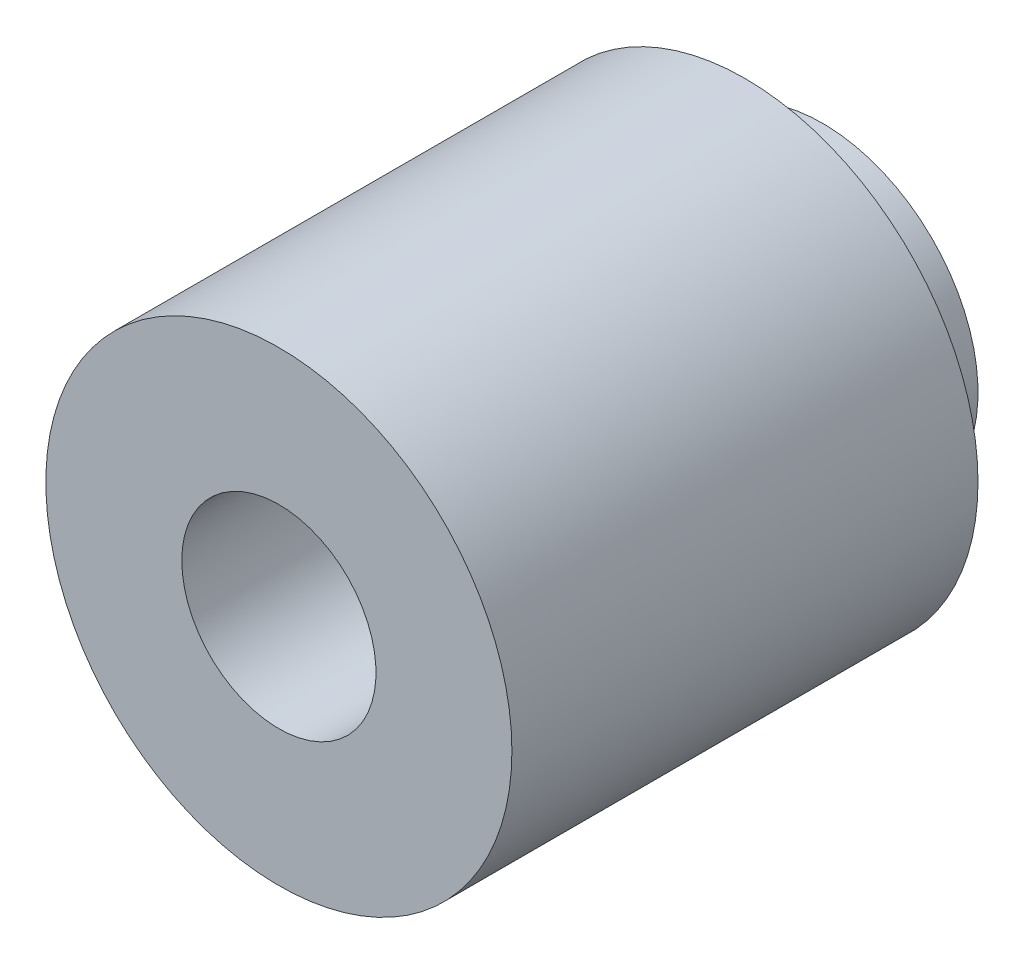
ISO-10303-21;
HEADER;
FILE_DESCRIPTION(('STEP AP214'),'2;1');
FILE_NAME('part.step','',(''),(''),'','','');
FILE_SCHEMA(('AUTOMOTIVE_DESIGN { 1 0 10303 214 1 1 1 1 }'));
ENDSEC;
DATA;
#1=APPLICATION_CONTEXT('core data for automotive mechanical design processes');
#2=APPLICATION_PROTOCOL_DEFINITION('international standard','automotive_design',2000,#1);
#3=PRODUCT_CONTEXT('',#1,'mechanical');
#4=PRODUCT('Part','Part','',(#3));
#5=PRODUCT_RELATED_PRODUCT_CATEGORY('part','',(#4));
#6=PRODUCT_DEFINITION_FORMATION('','',#4);
#7=PRODUCT_DEFINITION_CONTEXT('part definition',#1,'design');
#8=PRODUCT_DEFINITION('design','',#6,#7);
#9=PRODUCT_DEFINITION_SHAPE('','',#8);
#10=(LENGTH_UNIT() NAMED_UNIT(*) SI_UNIT(.MILLI.,.METRE.));
#11=(NAMED_UNIT(*) PLANE_ANGLE_UNIT() SI_UNIT($,.RADIAN.));
#12=(NAMED_UNIT(*) SI_UNIT($,.STERADIAN.) SOLID_ANGLE_UNIT());
#13=UNCERTAINTY_MEASURE_WITH_UNIT(LENGTH_MEASURE(1.E-05),#10,'distance_accuracy_value','');
#14=(GEOMETRIC_REPRESENTATION_CONTEXT(3) GLOBAL_UNCERTAINTY_ASSIGNED_CONTEXT((#13)) GLOBAL_UNIT_ASSIGNED_CONTEXT((#10,
#11,#12)) REPRESENTATION_CONTEXT('',''));
#15=CARTESIAN_POINT('',(0.,0.,0.));
#16=DIRECTION('',(0.,0.,1.));
#17=DIRECTION('',(1.,0.,0.));
#18=AXIS2_PLACEMENT_3D('',#15,#16,#17);
#19=CARTESIAN_POINT('',(0.,0.,48.));
#20=DIRECTION('',(0.,0.,1.));
#21=DIRECTION('',(1.,0.,0.));
#22=AXIS2_PLACEMENT_3D('',#19,#20,#21);
#23=CYLINDRICAL_SURFACE('',#22,12.);
#24=CARTESIAN_POINT('',(0.,0.,28.));
#25=DIRECTION('',(0.,0.,1.));
#26=DIRECTION('',(1.,0.,0.));
#27=AXIS2_PLACEMENT_3D('',#24,#25,#26);
#28=CIRCLE('',#27,12.);
#29=CARTESIAN_POINT('',(12.,0.,28.));
#30=VERTEX_POINT('',#29);
#31=EDGE_CURVE('E8',#30,#30,#28,.T.);
#32=ORIENTED_EDGE('',*,*,#31,.F.);
#33=EDGE_LOOP('',(#32));
#34=FACE_BOUND('',#33,.T.);
#35=CARTESIAN_POINT('',(0.,0.,4.));
#36=DIRECTION('',(0.,0.,-1.));
#37=DIRECTION('',(-1.,0.,0.));
#38=AXIS2_PLACEMENT_3D('',#35,#36,#37);
#39=CIRCLE('',#38,12.);
#40=CARTESIAN_POINT('',(-12.,0.,4.));
#41=VERTEX_POINT('',#40);
#42=EDGE_CURVE('E28',#41,#41,#39,.F.);
#43=ORIENTED_EDGE('',*,*,#42,.T.);
#44=EDGE_LOOP('',(#43));
#45=FACE_BOUND('',#44,.T.);
#46=ADVANCED_FACE('F12',(#34,#45),#23,.T.);
#47=CARTESIAN_POINT('',(0.,0.,28.));
#48=DIRECTION('',(0.,0.,1.));
#49=DIRECTION('',(1.,0.,0.));
#50=AXIS2_PLACEMENT_3D('',#47,#48,#49);
#51=PLANE('',#50);
#52=ORIENTED_EDGE('',*,*,#31,.T.);
#53=EDGE_LOOP('',(#52));
#54=FACE_BOUND('',#53,.T.);
#55=CARTESIAN_POINT('',(0.,0.,28.));
#56=DIRECTION('',(0.,0.,-1.));
#57=DIRECTION('',(-1.,0.,0.));
#58=AXIS2_PLACEMENT_3D('',#55,#56,#57);
#59=CIRCLE('',#58,5.);
#60=CARTESIAN_POINT('',(-5.,0.,28.));
#61=VERTEX_POINT('',#60);
#62=EDGE_CURVE('E25',#61,#61,#59,.T.);
#63=ORIENTED_EDGE('',*,*,#62,.T.);
#64=EDGE_LOOP('',(#63));
#65=FACE_BOUND('',#64,.T.);
#66=ADVANCED_FACE('F41',(#54,#65),#51,.T.);
#67=CARTESIAN_POINT('',(0.,0.,19.));
#68=DIRECTION('',(0.,0.,1.));
#69=DIRECTION('',(1.,0.,0.));
#70=AXIS2_PLACEMENT_3D('',#67,#68,#69);
#71=CYLINDRICAL_SURFACE('',#70,5.);
#72=CARTESIAN_POINT('',(0.,0.,19.));
#73=DIRECTION('',(0.,0.,-1.));
#74=DIRECTION('',(-1.,0.,0.));
#75=AXIS2_PLACEMENT_3D('',#72,#73,#74);
#76=CIRCLE('',#75,5.);
#77=CARTESIAN_POINT('',(-5.,0.,19.));
#78=VERTEX_POINT('',#77);
#79=EDGE_CURVE('E20',#78,#78,#76,.T.);
#80=ORIENTED_EDGE('',*,*,#79,.T.);
#81=EDGE_LOOP('',(#80));
#82=FACE_BOUND('',#81,.T.);
#83=ORIENTED_EDGE('',*,*,#62,.F.);
#84=EDGE_LOOP('',(#83));
#85=FACE_BOUND('',#84,.T.);
#86=ADVANCED_FACE('F43',(#82,#85),#71,.F.);
#87=CARTESIAN_POINT('',(0.,0.,19.));
#88=DIRECTION('',(0.,0.,-1.));
#89=DIRECTION('',(-1.,0.,0.));
#90=AXIS2_PLACEMENT_3D('',#87,#88,#89);
#91=PLANE('',#90);
#92=ORIENTED_EDGE('',*,*,#79,.F.);
#93=EDGE_LOOP('',(#92));
#94=FACE_BOUND('',#93,.T.);
#95=ADVANCED_FACE('F45',(#94),#91,.F.);
#96=CARTESIAN_POINT('',(0.,0.,-12.));
#97=DIRECTION('',(0.,0.,-1.));
#98=DIRECTION('',(-1.,0.,0.));
#99=AXIS2_PLACEMENT_3D('',#96,#97,#98);
#100=CYLINDRICAL_SURFACE('',#99,8.);
#101=CARTESIAN_POINT('',(0.,0.,0.));
#102=DIRECTION('',(0.,0.,-1.));
#103=DIRECTION('',(-1.,0.,0.));
#104=AXIS2_PLACEMENT_3D('',#101,#102,#103);
#105=CIRCLE('',#104,8.);
#106=CARTESIAN_POINT('',(-8.,0.,0.));
#107=VERTEX_POINT('',#106);
#108=EDGE_CURVE('E16',#107,#107,#105,.F.);
#109=ORIENTED_EDGE('',*,*,#108,.T.);
#110=EDGE_LOOP('',(#109));
#111=FACE_BOUND('',#110,.T.);
#112=CARTESIAN_POINT('',(0.,0.,4.));
#113=DIRECTION('',(0.,0.,-1.));
#114=DIRECTION('',(-1.,0.,0.));
#115=AXIS2_PLACEMENT_3D('',#112,#113,#114);
#116=CIRCLE('',#115,8.);
#117=CARTESIAN_POINT('',(-8.,0.,4.));
#118=VERTEX_POINT('',#117);
#119=EDGE_CURVE('E30',#118,#118,#116,.T.);
#120=ORIENTED_EDGE('',*,*,#119,.T.);
#121=EDGE_LOOP('',(#120));
#122=FACE_BOUND('',#121,.T.);
#123=ADVANCED_FACE('F48',(#111,#122),#100,.T.);
#124=CARTESIAN_POINT('',(0.,8.,4.));
#125=DIRECTION('',(0.,0.,-1.));
#126=DIRECTION('',(-1.,0.,0.));
#127=AXIS2_PLACEMENT_3D('',#124,#125,#126);
#128=PLANE('',#127);
#129=ORIENTED_EDGE('',*,*,#42,.F.);
#130=EDGE_LOOP('',(#129));
#131=FACE_BOUND('',#130,.T.);
#132=ORIENTED_EDGE('',*,*,#119,.F.);
#133=EDGE_LOOP('',(#132));
#134=FACE_BOUND('',#133,.T.);
#135=ADVANCED_FACE('F58',(#131,#134),#128,.T.);
#136=CARTESIAN_POINT('',(12.,0.,0.));
#137=DIRECTION('',(0.,0.,-1.));
#138=DIRECTION('',(-1.,0.,0.));
#139=AXIS2_PLACEMENT_3D('',#136,#137,#138);
#140=PLANE('',#139);
#141=ORIENTED_EDGE('',*,*,#108,.F.);
#142=EDGE_LOOP('',(#141));
#143=FACE_BOUND('',#142,.T.);
#144=ADVANCED_FACE('F14',(#143),#140,.T.);
#145=CLOSED_SHELL('',(#46,#66,#86,#95,#123,#135,#144));
#146=MANIFOLD_SOLID_BREP('B1',#145);
#147=ADVANCED_BREP_SHAPE_REPRESENTATION('',(#18,#146),#14);
#148=SHAPE_DEFINITION_REPRESENTATION(#9,#147);
ENDSEC;
END-ISO-10303-21;
